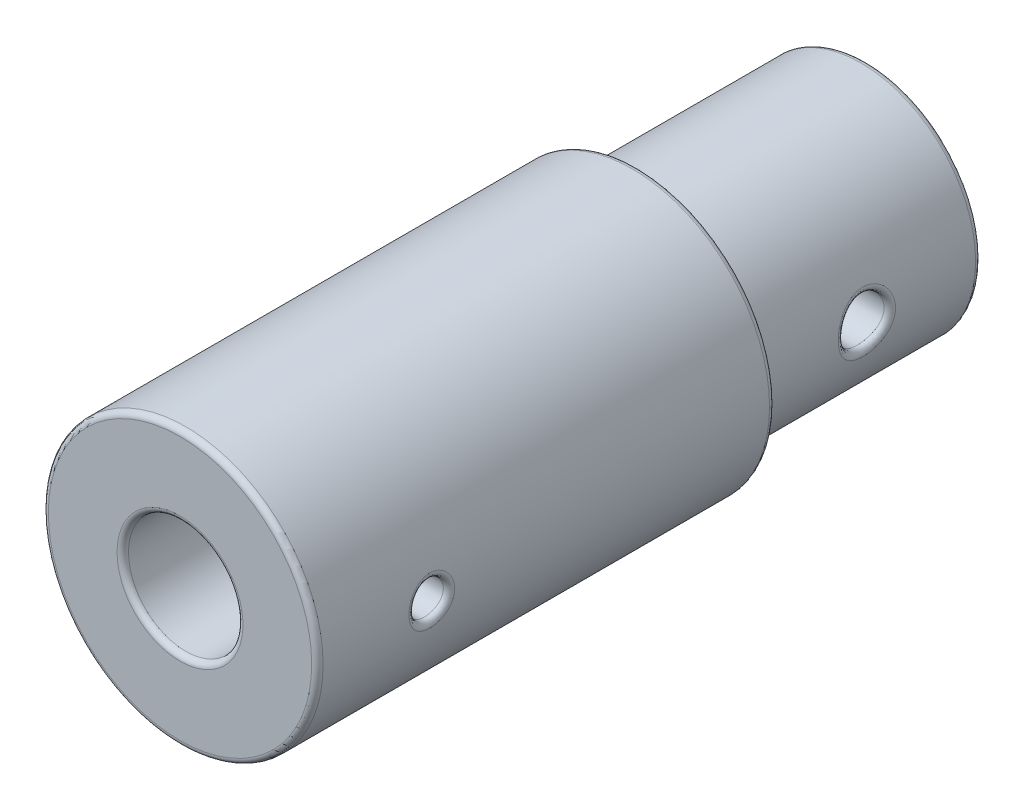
from build123d import *

# Parameters (mm, degrees)
SKETCH_2_R          = 1.5
SKETCH_2_R_2        = 2
CUT_EXTRUDE_1_DEPTH = 15
FILLET_1_R          = 0.5


with BuildPart() as part:
    # Sketch 1 → Revolve 1 (revolve)
    with BuildSketch(Plane(origin=(0, 0, 0), x_dir=(0, 0, -1), z_dir=(1, 0, 0)), mode=Mode.PRIVATE) as revolve_1_sk:
        Polygon((0, 5), (16.995696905, 5), (20, 0), (60, 0), (60, 10), (40, 10), (40, 12), (0, 12), align=None)
    revolve(revolve_1_sk.sketch.rotate(Axis((0, 0, -20), (0, 0, -1)), 90), axis=Axis((0, 0, -20), (0, 0, -1)))

    # Sketch 2 → Cut-Extrude 1 (cut, symmetric)
    with BuildSketch(Plane(origin=(0, 0, 0), x_dir=(0, 0, -1), z_dir=(1, 0, 0))):
        with Locations((10, 0)):
            Circle(SKETCH_2_R)
        with Locations((50, 0)):
            Circle(SKETCH_2_R_2)
    extrude(amount=CUT_EXTRUDE_1_DEPTH, both=True, mode=Mode.SUBTRACT)

    # Fillet 1
    fillet_1_edges = [part.edges().sort_by_distance(p)[0] for p in [
        (11.9058809, 1.5, -10),
        (4.769696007, -1.5, -10),
        (-11.99999999, -2e-09, -8.499999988),
        (-5, 0, -8.5),
        (-10.000000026, 1e-09, -48.000000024),
        (9.797958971, 2, -50),
        (-12, 0, 0),
        (-12, 0, -40),
        (-10, 0, -40),
        (-10, 0, -60),
        (-5, 0, -16.995696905),
        (-5, 0, 0),
    ]]
    fillet(fillet_1_edges, radius=FILLET_1_R)


solid = part.part
